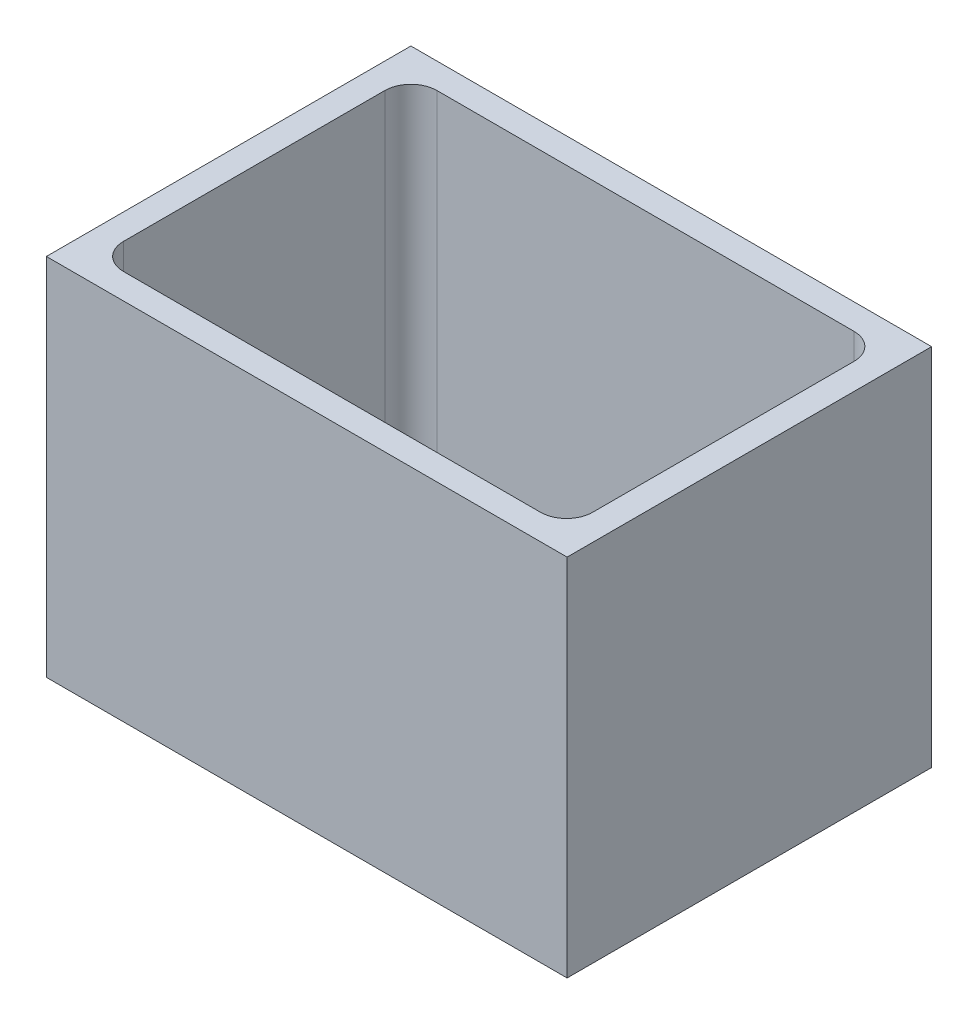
from build123d import *

# Parameters (mm, degrees)
SKETCH1_W           = 127
SKETCH1_H           = 88.9
BOSS_EXTRUDE1_DEPTH = 88.9
CUT_EXTRUDE1_DEPTH  = 130.126071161


with BuildPart() as part:
    # Sketch1 → Boss-Extrude1 (new body)
    with BuildSketch(Plane(origin=(0, 0, 0), x_dir=(1, 0, 0), z_dir=(0, 1, 0))):
        with Locations((-12.796211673, -9.85672461)):
            Rectangle(SKETCH1_W, SKETCH1_H)
    extrude(amount=BOSS_EXTRUDE1_DEPTH)

    # Sketch2 → Cut-Extrude1 (cut, through all)
    with BuildSketch(Plane(origin=(0, 88.9, 0), x_dir=(1, 0, 0), z_dir=(0, 1, 0))):
        with BuildLine():
            Line((38.003788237, 28.37027539), (-63.723211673, 28.37027539))
            ThreePointArc((-63.723211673, 28.37027539), (-68.213339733, 26.51040345), (-70.073211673, 22.02027539))
            Line((-70.073211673, 22.02027539), (-70.073211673, -41.733724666))
            ThreePointArc((-70.073211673, -41.733724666), (-68.213339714, -46.22385269), (-63.723211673, -48.08372461))
            Line((-63.723211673, -48.08372461), (38.003788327, -48.08372461))
            ThreePointArc((38.003788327, -48.08372461), (42.493916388, -46.223852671), (44.353788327, -41.73372461))
            Line((44.353788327, -41.73372461), (44.353788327, 22.02027539))
            ThreePointArc((44.353788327, 22.02027539), (42.493916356, 26.510403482), (38.003788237, 28.37027539))
        make_face()
    extrude(amount=-CUT_EXTRUDE1_DEPTH, mode=Mode.SUBTRACT)


solid = part.part
